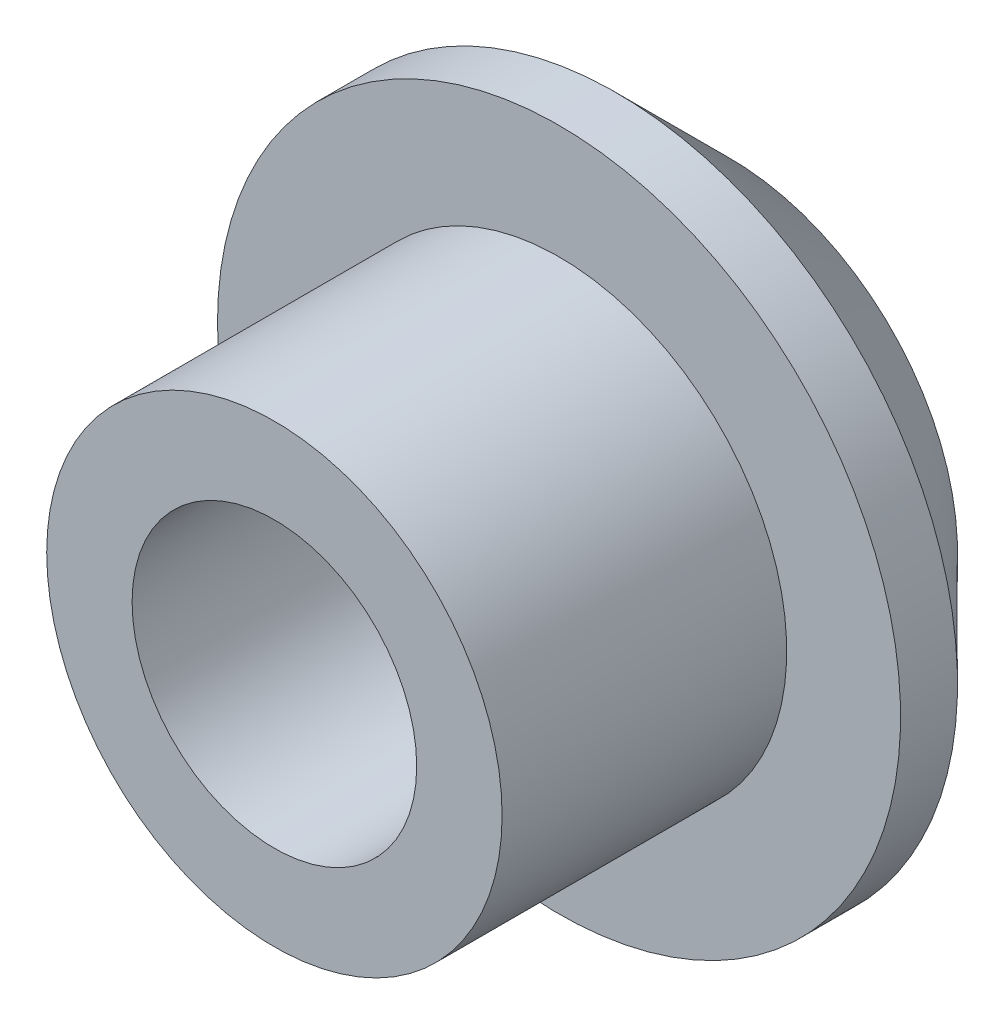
from build123d import *

# Parameters (mm, degrees)
ESQUISSE1_R                       = 4
BOSS_EXTRU_1_DEPTH                = 5
ESQUISSE2_R                       = 6
BOSS_EXTRU_2_DEPTH                = 3
DIAM_TRE_DU_PER_AGE_0_15_0_15_1_D = 5
CHANFREIN1_SIZE                   = 2


with BuildPart() as part:
    # Esquisse1 → Boss.-Extru.1 (new body)
    with BuildSketch(Plane.XY):
        Circle(ESQUISSE1_R)
    extrude(amount=BOSS_EXTRU_1_DEPTH)

    # Esquisse2 → Boss.-Extru.2 (add)
    with BuildSketch(Plane(origin=(0, 0, 0), x_dir=(-1, 0, 0), z_dir=(0, 0, -1))):
        Circle(ESQUISSE2_R)
    extrude(amount=BOSS_EXTRU_2_DEPTH)

    # Diam_tre du per_age _0.15 _0.15_1 (through all)
    with Locations(Plane(origin=(0, 0, -3), x_dir=(-1, 0, 0), z_dir=(0, 0, -1))):
        with Locations((0, 0)):
            Hole(DIAM_TRE_DU_PER_AGE_0_15_0_15_1_D / 2)

    # Chanfrein1
    chanfrein1_edges = [part.edges().sort_by_distance(p)[0] for p in [
        (6, 0, -3),
    ]]
    chamfer(chanfrein1_edges, length=CHANFREIN1_SIZE)


solid = part.part
